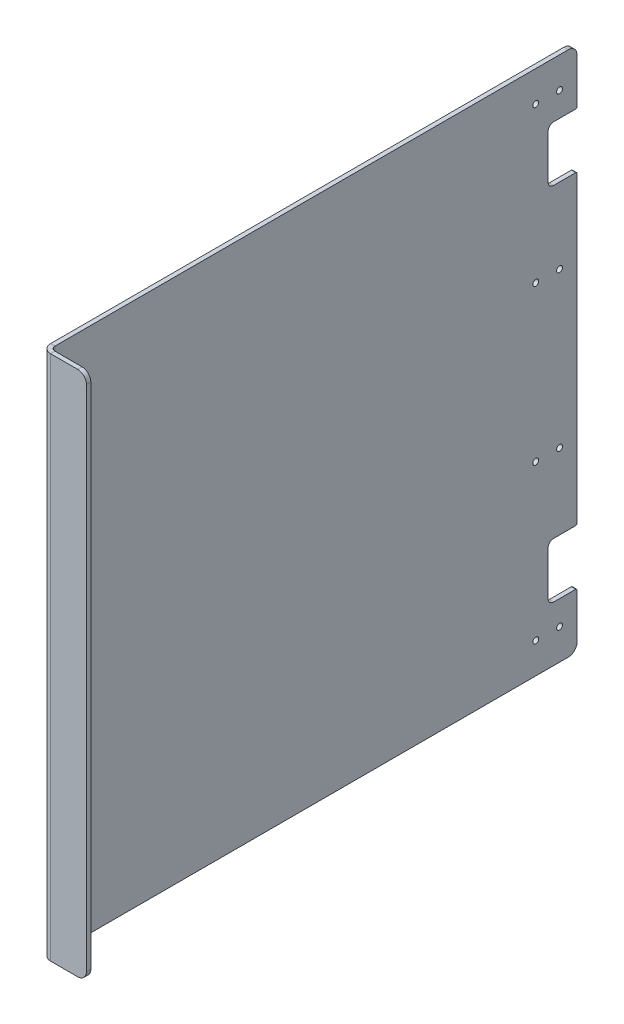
ISO-10303-21;
HEADER;
FILE_DESCRIPTION(('STEP AP214'),'2;1');
FILE_NAME('part.step','',(''),(''),'','','');
FILE_SCHEMA(('AUTOMOTIVE_DESIGN { 1 0 10303 214 1 1 1 1 }'));
ENDSEC;
DATA;
#1=APPLICATION_CONTEXT('core data for automotive mechanical design processes');
#2=APPLICATION_PROTOCOL_DEFINITION('international standard','automotive_design',2000,#1);
#3=PRODUCT_CONTEXT('',#1,'mechanical');
#4=PRODUCT('Part','Part','',(#3));
#5=PRODUCT_RELATED_PRODUCT_CATEGORY('part','',(#4));
#6=PRODUCT_DEFINITION_FORMATION('','',#4);
#7=PRODUCT_DEFINITION_CONTEXT('part definition',#1,'design');
#8=PRODUCT_DEFINITION('design','',#6,#7);
#9=PRODUCT_DEFINITION_SHAPE('','',#8);
#10=(LENGTH_UNIT() NAMED_UNIT(*) SI_UNIT(.MILLI.,.METRE.));
#11=(NAMED_UNIT(*) PLANE_ANGLE_UNIT() SI_UNIT($,.RADIAN.));
#12=(NAMED_UNIT(*) SI_UNIT($,.STERADIAN.) SOLID_ANGLE_UNIT());
#13=UNCERTAINTY_MEASURE_WITH_UNIT(LENGTH_MEASURE(1.E-05),#10,'distance_accuracy_value','');
#14=(GEOMETRIC_REPRESENTATION_CONTEXT(3) GLOBAL_UNCERTAINTY_ASSIGNED_CONTEXT((#13)) GLOBAL_UNIT_ASSIGNED_CONTEXT((#10,
#11,#12)) REPRESENTATION_CONTEXT('',''));
#15=CARTESIAN_POINT('',(0.,0.,0.));
#16=DIRECTION('',(0.,0.,1.));
#17=DIRECTION('',(1.,0.,0.));
#18=AXIS2_PLACEMENT_3D('',#15,#16,#17);
#19=CARTESIAN_POINT('',(-3.175,-191.,-385.5));
#20=DIRECTION('',(0.,0.,-1.));
#21=DIRECTION('',(-1.,0.,0.));
#22=AXIS2_PLACEMENT_3D('',#19,#20,#21);
#23=PLANE('',#22);
#24=DIRECTION('',(0.,1.,0.));
#25=VECTOR('',#24,1.);
#26=CARTESIAN_POINT('',(0.,-191.,-385.5));
#27=LINE('',#26,#25);
#28=CARTESIAN_POINT('',(0.,152.,-385.5));
#29=VERTEX_POINT('',#28);
#30=CARTESIAN_POINT('',(0.,184.65,-385.5));
#31=VERTEX_POINT('',#30);
#32=EDGE_CURVE('E329',#29,#31,#27,.T.);
#33=ORIENTED_EDGE('',*,*,#32,.F.);
#34=DIRECTION('',(-1.,0.,0.));
#35=VECTOR('',#34,1.);
#36=CARTESIAN_POINT('',(-3.175,152.,-385.5));
#37=LINE('',#36,#35);
#38=CARTESIAN_POINT('',(-3.175,152.,-385.5));
#39=VERTEX_POINT('',#38);
#40=EDGE_CURVE('E427',#29,#39,#37,.T.);
#41=ORIENTED_EDGE('',*,*,#40,.T.);
#42=DIRECTION('',(0.,1.,0.));
#43=VECTOR('',#42,1.);
#44=CARTESIAN_POINT('',(-3.175,-191.,-385.5));
#45=LINE('',#44,#43);
#46=CARTESIAN_POINT('',(-3.175,184.65,-385.5));
#47=VERTEX_POINT('',#46);
#48=EDGE_CURVE('E318',#39,#47,#45,.T.);
#49=ORIENTED_EDGE('',*,*,#48,.T.);
#50=DIRECTION('',(1.,0.,0.));
#51=VECTOR('',#50,1.);
#52=CARTESIAN_POINT('',(-3.175,184.65,-385.5));
#53=LINE('',#52,#51);
#54=EDGE_CURVE('E336',#47,#31,#53,.T.);
#55=ORIENTED_EDGE('',*,*,#54,.T.);
#56=EDGE_LOOP('',(#33,#41,#49,#55));
#57=FACE_BOUND('',#56,.T.);
#58=ADVANCED_FACE('F60',(#57),#23,.T.);
#59=CARTESIAN_POINT('',(-3.175,-110.,-385.5));
#60=VERTEX_POINT('',#59);
#61=CARTESIAN_POINT('',(-3.175,110.,-385.5));
#62=VERTEX_POINT('',#61);
#63=EDGE_CURVE('E324',#60,#62,#45,.T.);
#64=ORIENTED_EDGE('',*,*,#63,.T.);
#65=DIRECTION('',(-1.,0.,0.));
#66=VECTOR('',#65,1.);
#67=CARTESIAN_POINT('',(-3.175,110.,-385.5));
#68=LINE('',#67,#66);
#69=CARTESIAN_POINT('',(0.,110.,-385.5));
#70=VERTEX_POINT('',#69);
#71=EDGE_CURVE('E13',#62,#70,#68,.F.);
#72=ORIENTED_EDGE('',*,*,#71,.T.);
#73=CARTESIAN_POINT('',(0.,-110.,-385.5));
#74=VERTEX_POINT('',#73);
#75=EDGE_CURVE('E333',#74,#70,#27,.T.);
#76=ORIENTED_EDGE('',*,*,#75,.F.);
#77=DIRECTION('',(-1.,0.,0.));
#78=VECTOR('',#77,1.);
#79=CARTESIAN_POINT('',(-3.175,-110.,-385.5));
#80=LINE('',#79,#78);
#81=EDGE_CURVE('E403',#74,#60,#80,.T.);
#82=ORIENTED_EDGE('',*,*,#81,.T.);
#83=EDGE_LOOP('',(#64,#72,#76,#82));
#84=FACE_BOUND('',#83,.T.);
#85=ADVANCED_FACE('F492',(#84),#23,.T.);
#86=CARTESIAN_POINT('',(-3.175,0.,0.));
#87=DIRECTION('',(-1.,0.,0.));
#88=DIRECTION('',(0.,0.,1.));
#89=AXIS2_PLACEMENT_3D('',#86,#87,#88);
#90=PLANE('',#89);
#91=CARTESIAN_POINT('',(-3.175,168.65,-372.8));
#92=DIRECTION('',(-1.,0.,0.));
#93=DIRECTION('',(0.,0.,1.));
#94=AXIS2_PLACEMENT_3D('',#91,#92,#93);
#95=CIRCLE('',#94,2.14999999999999);
#96=CARTESIAN_POINT('',(-3.175,168.65,-370.65));
#97=VERTEX_POINT('',#96);
#98=EDGE_CURVE('E672',#97,#97,#95,.T.);
#99=ORIENTED_EDGE('',*,*,#98,.F.);
#100=EDGE_LOOP('',(#99));
#101=FACE_BOUND('',#100,.T.);
#102=CARTESIAN_POINT('',(-3.175,168.65,-355.5));
#103=DIRECTION('',(-1.,0.,0.));
#104=DIRECTION('',(0.,0.,1.));
#105=AXIS2_PLACEMENT_3D('',#102,#103,#104);
#106=CIRCLE('',#105,2.14999999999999);
#107=CARTESIAN_POINT('',(-3.175,168.65,-353.35));
#108=VERTEX_POINT('',#107);
#109=EDGE_CURVE('E666',#108,#108,#106,.T.);
#110=ORIENTED_EDGE('',*,*,#109,.F.);
#111=EDGE_LOOP('',(#110));
#112=FACE_BOUND('',#111,.T.);
#113=CARTESIAN_POINT('',(-3.175,56.2166666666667,-355.5));
#114=DIRECTION('',(-1.,0.,0.));
#115=DIRECTION('',(0.,0.,1.));
#116=AXIS2_PLACEMENT_3D('',#113,#114,#115);
#117=CIRCLE('',#116,2.14999999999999);
#118=CARTESIAN_POINT('',(-3.175,56.2166666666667,-353.35));
#119=VERTEX_POINT('',#118);
#120=EDGE_CURVE('E660',#119,#119,#117,.T.);
#121=ORIENTED_EDGE('',*,*,#120,.F.);
#122=EDGE_LOOP('',(#121));
#123=FACE_BOUND('',#122,.T.);
#124=CARTESIAN_POINT('',(-3.175,56.2166666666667,-372.8));
#125=DIRECTION('',(-1.,0.,0.));
#126=DIRECTION('',(0.,0.,1.));
#127=AXIS2_PLACEMENT_3D('',#124,#125,#126);
#128=CIRCLE('',#127,2.14999999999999);
#129=CARTESIAN_POINT('',(-3.175,56.2166666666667,-370.65));
#130=VERTEX_POINT('',#129);
#131=EDGE_CURVE('E654',#130,#130,#128,.T.);
#132=ORIENTED_EDGE('',*,*,#131,.F.);
#133=EDGE_LOOP('',(#132));
#134=FACE_BOUND('',#133,.T.);
#135=CARTESIAN_POINT('',(-3.175,-56.2166666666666,-355.5));
#136=DIRECTION('',(-1.,0.,0.));
#137=DIRECTION('',(0.,0.,1.));
#138=AXIS2_PLACEMENT_3D('',#135,#136,#137);
#139=CIRCLE('',#138,2.14999999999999);
#140=CARTESIAN_POINT('',(-3.175,-56.2166666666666,-353.35));
#141=VERTEX_POINT('',#140);
#142=EDGE_CURVE('E648',#141,#141,#139,.T.);
#143=ORIENTED_EDGE('',*,*,#142,.F.);
#144=EDGE_LOOP('',(#143));
#145=FACE_BOUND('',#144,.T.);
#146=CARTESIAN_POINT('',(-3.175,-56.2166666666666,-372.8));
#147=DIRECTION('',(-1.,0.,0.));
#148=DIRECTION('',(0.,0.,1.));
#149=AXIS2_PLACEMENT_3D('',#146,#147,#148);
#150=CIRCLE('',#149,2.14999999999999);
#151=CARTESIAN_POINT('',(-3.175,-56.2166666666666,-370.65));
#152=VERTEX_POINT('',#151);
#153=EDGE_CURVE('E642',#152,#152,#150,.T.);
#154=ORIENTED_EDGE('',*,*,#153,.F.);
#155=EDGE_LOOP('',(#154));
#156=FACE_BOUND('',#155,.T.);
#157=CARTESIAN_POINT('',(-3.175,-168.65,-372.8));
#158=DIRECTION('',(-1.,0.,0.));
#159=DIRECTION('',(0.,0.,1.));
#160=AXIS2_PLACEMENT_3D('',#157,#158,#159);
#161=CIRCLE('',#160,2.14999999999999);
#162=CARTESIAN_POINT('',(-3.175,-168.65,-370.65));
#163=VERTEX_POINT('',#162);
#164=EDGE_CURVE('E636',#163,#163,#161,.T.);
#165=ORIENTED_EDGE('',*,*,#164,.F.);
#166=EDGE_LOOP('',(#165));
#167=FACE_BOUND('',#166,.T.);
#168=CARTESIAN_POINT('',(-3.175,-168.65,-355.5));
#169=DIRECTION('',(-1.,0.,0.));
#170=DIRECTION('',(0.,0.,1.));
#171=AXIS2_PLACEMENT_3D('',#168,#169,#170);
#172=CIRCLE('',#171,2.14999999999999);
#173=CARTESIAN_POINT('',(-3.175,-168.65,-353.35));
#174=VERTEX_POINT('',#173);
#175=EDGE_CURVE('E459',#174,#174,#172,.T.);
#176=ORIENTED_EDGE('',*,*,#175,.F.);
#177=EDGE_LOOP('',(#176));
#178=FACE_BOUND('',#177,.T.);
#179=ORIENTED_EDGE('',*,*,#48,.F.);
#180=CARTESIAN_POINT('',(-3.175,152.,-384.5));
#181=DIRECTION('',(-1.,0.,0.));
#182=DIRECTION('',(0.,0.,1.));
#183=AXIS2_PLACEMENT_3D('',#180,#181,#182);
#184=CIRCLE('',#183,1.);
#185=CARTESIAN_POINT('',(-3.175,151.,-384.5));
#186=VERTEX_POINT('',#185);
#187=EDGE_CURVE('E432',#39,#186,#184,.T.);
#188=ORIENTED_EDGE('',*,*,#187,.T.);
#189=DIRECTION('',(0.,0.,1.));
#190=VECTOR('',#189,1.);
#191=CARTESIAN_POINT('',(-3.175,151.,-385.5));
#192=LINE('',#191,#190);
#193=CARTESIAN_POINT('',(-3.175,151.,-368.5));
#194=VERTEX_POINT('',#193);
#195=EDGE_CURVE('E456',#186,#194,#192,.T.);
#196=ORIENTED_EDGE('',*,*,#195,.T.);
#197=CARTESIAN_POINT('',(-3.175,147.,-368.5));
#198=DIRECTION('',(-1.,0.,0.));
#199=DIRECTION('',(0.,0.,1.));
#200=AXIS2_PLACEMENT_3D('',#197,#198,#199);
#201=CIRCLE('',#200,4.);
#202=CARTESIAN_POINT('',(-3.175,147.,-364.5));
#203=VERTEX_POINT('',#202);
#204=EDGE_CURVE('E418',#194,#203,#201,.F.);
#205=ORIENTED_EDGE('',*,*,#204,.T.);
#206=DIRECTION('',(0.,-1.,0.));
#207=VECTOR('',#206,1.);
#208=CARTESIAN_POINT('',(-3.175,151.,-364.5));
#209=LINE('',#208,#207);
#210=CARTESIAN_POINT('',(-3.175,115.,-364.5));
#211=VERTEX_POINT('',#210);
#212=EDGE_CURVE('E453',#203,#211,#209,.T.);
#213=ORIENTED_EDGE('',*,*,#212,.T.);
#214=CARTESIAN_POINT('',(-3.175,115.,-368.5));
#215=DIRECTION('',(-1.,0.,0.));
#216=DIRECTION('',(0.,0.,1.));
#217=AXIS2_PLACEMENT_3D('',#214,#215,#216);
#218=CIRCLE('',#217,4.);
#219=CARTESIAN_POINT('',(-3.175,111.,-368.5));
#220=VERTEX_POINT('',#219);
#221=EDGE_CURVE('E423',#211,#220,#218,.F.);
#222=ORIENTED_EDGE('',*,*,#221,.T.);
#223=DIRECTION('',(0.,0.,-1.));
#224=VECTOR('',#223,1.);
#225=CARTESIAN_POINT('',(-3.175,111.,-385.5));
#226=LINE('',#225,#224);
#227=CARTESIAN_POINT('',(-3.175,111.,-384.5));
#228=VERTEX_POINT('',#227);
#229=EDGE_CURVE('E444',#220,#228,#226,.T.);
#230=ORIENTED_EDGE('',*,*,#229,.T.);
#231=CARTESIAN_POINT('',(-3.175,110.,-384.5));
#232=DIRECTION('',(-1.,0.,0.));
#233=DIRECTION('',(0.,0.,1.));
#234=AXIS2_PLACEMENT_3D('',#231,#232,#233);
#235=CIRCLE('',#234,1.);
#236=EDGE_CURVE('E430',#228,#62,#235,.T.);
#237=ORIENTED_EDGE('',*,*,#236,.T.);
#238=ORIENTED_EDGE('',*,*,#63,.F.);
#239=CARTESIAN_POINT('',(-3.175,-110.,-384.5));
#240=DIRECTION('',(-1.,0.,0.));
#241=DIRECTION('',(0.,0.,1.));
#242=AXIS2_PLACEMENT_3D('',#239,#240,#241);
#243=CIRCLE('',#242,1.);
#244=CARTESIAN_POINT('',(-3.175,-111.,-384.5));
#245=VERTEX_POINT('',#244);
#246=EDGE_CURVE('E393',#60,#245,#243,.T.);
#247=ORIENTED_EDGE('',*,*,#246,.T.);
#248=DIRECTION('',(0.,0.,-1.));
#249=VECTOR('',#248,1.);
#250=CARTESIAN_POINT('',(-3.175,-111.,-385.5));
#251=LINE('',#250,#249);
#252=CARTESIAN_POINT('',(-3.175,-111.,-368.5));
#253=VERTEX_POINT('',#252);
#254=EDGE_CURVE('E469',#253,#245,#251,.T.);
#255=ORIENTED_EDGE('',*,*,#254,.F.);
#256=CARTESIAN_POINT('',(-3.175,-115.,-368.5));
#257=DIRECTION('',(-1.,0.,0.));
#258=DIRECTION('',(0.,0.,1.));
#259=AXIS2_PLACEMENT_3D('',#256,#257,#258);
#260=CIRCLE('',#259,4.);
#261=CARTESIAN_POINT('',(-3.175,-115.,-364.5));
#262=VERTEX_POINT('',#261);
#263=EDGE_CURVE('E386',#253,#262,#260,.F.);
#264=ORIENTED_EDGE('',*,*,#263,.T.);
#265=DIRECTION('',(0.,1.,0.));
#266=VECTOR('',#265,1.);
#267=CARTESIAN_POINT('',(-3.175,-151.,-364.5));
#268=LINE('',#267,#266);
#269=CARTESIAN_POINT('',(-3.175,-147.,-364.5));
#270=VERTEX_POINT('',#269);
#271=EDGE_CURVE('E476',#270,#262,#268,.T.);
#272=ORIENTED_EDGE('',*,*,#271,.F.);
#273=CARTESIAN_POINT('',(-3.175,-147.,-368.5));
#274=DIRECTION('',(-1.,0.,0.));
#275=DIRECTION('',(0.,0.,1.));
#276=AXIS2_PLACEMENT_3D('',#273,#274,#275);
#277=CIRCLE('',#276,4.);
#278=CARTESIAN_POINT('',(-3.175,-151.,-368.5));
#279=VERTEX_POINT('',#278);
#280=EDGE_CURVE('E381',#270,#279,#277,.F.);
#281=ORIENTED_EDGE('',*,*,#280,.T.);
#282=DIRECTION('',(0.,0.,1.));
#283=VECTOR('',#282,1.);
#284=CARTESIAN_POINT('',(-3.175,-151.,-385.5));
#285=LINE('',#284,#283);
#286=CARTESIAN_POINT('',(-3.175,-151.,-384.5));
#287=VERTEX_POINT('',#286);
#288=EDGE_CURVE('E474',#287,#279,#285,.T.);
#289=ORIENTED_EDGE('',*,*,#288,.F.);
#290=CARTESIAN_POINT('',(-3.175,-152.,-384.5));
#291=DIRECTION('',(-1.,0.,0.));
#292=DIRECTION('',(0.,0.,1.));
#293=AXIS2_PLACEMENT_3D('',#290,#291,#292);
#294=CIRCLE('',#293,1.);
#295=CARTESIAN_POINT('',(-3.175,-152.,-385.5));
#296=VERTEX_POINT('',#295);
#297=EDGE_CURVE('E395',#287,#296,#294,.T.);
#298=ORIENTED_EDGE('',*,*,#297,.T.);
#299=CARTESIAN_POINT('',(-3.175,-184.65,-385.5));
#300=VERTEX_POINT('',#299);
#301=EDGE_CURVE('E320',#300,#296,#45,.T.);
#302=ORIENTED_EDGE('',*,*,#301,.F.);
#303=CARTESIAN_POINT('',(-3.175,-184.65,-379.15));
#304=DIRECTION('',(-1.,0.,0.));
#305=DIRECTION('',(0.,0.,1.));
#306=AXIS2_PLACEMENT_3D('',#303,#304,#305);
#307=CIRCLE('',#306,6.35);
#308=CARTESIAN_POINT('',(-3.175,-191.,-379.15));
#309=VERTEX_POINT('',#308);
#310=EDGE_CURVE('E345',#300,#309,#307,.T.);
#311=ORIENTED_EDGE('',*,*,#310,.T.);
#312=DIRECTION('',(0.,0.,-1.));
#313=VECTOR('',#312,1.);
#314=CARTESIAN_POINT('',(-3.175,-191.,0.));
#315=LINE('',#314,#313);
#316=CARTESIAN_POINT('',(-3.17499999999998,-191.,-6.34999999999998));
#317=VERTEX_POINT('',#316);
#318=EDGE_CURVE('E315',#317,#309,#315,.T.);
#319=ORIENTED_EDGE('',*,*,#318,.F.);
#320=DIRECTION('',(0.,-1.,0.));
#321=VECTOR('',#320,1.);
#322=CARTESIAN_POINT('',(-3.17499999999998,-191.,-6.34999999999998));
#323=LINE('',#322,#321);
#324=CARTESIAN_POINT('',(-3.175,191.,-6.34999999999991));
#325=VERTEX_POINT('',#324);
#326=EDGE_CURVE('E254',#317,#325,#323,.F.);
#327=ORIENTED_EDGE('',*,*,#326,.T.);
#328=DIRECTION('',(0.,0.,1.));
#329=VECTOR('',#328,1.);
#330=CARTESIAN_POINT('',(-3.175,191.,0.));
#331=LINE('',#330,#329);
#332=CARTESIAN_POINT('',(-3.175,191.,-379.15));
#333=VERTEX_POINT('',#332);
#334=EDGE_CURVE('E323',#333,#325,#331,.T.);
#335=ORIENTED_EDGE('',*,*,#334,.F.);
#336=CARTESIAN_POINT('',(-3.175,184.65,-379.15));
#337=DIRECTION('',(-1.,0.,0.));
#338=DIRECTION('',(0.,0.,1.));
#339=AXIS2_PLACEMENT_3D('',#336,#337,#338);
#340=CIRCLE('',#339,6.35);
#341=EDGE_CURVE('E347',#333,#47,#340,.T.);
#342=ORIENTED_EDGE('',*,*,#341,.T.);
#343=EDGE_LOOP('',(#179,#188,#196,#205,#213,#222,#230,#237,#238,#247,#255,#264,#272,#281,#289,
#298,#302,#311,#319,#327,#335,#342));
#344=FACE_BOUND('',#343,.T.);
#345=ADVANCED_FACE('F450',(#101,#112,#123,#134,#145,#156,#167,#178,#344),#90,.T.);
#346=CARTESIAN_POINT('',(0.,0.,0.));
#347=DIRECTION('',(-1.,0.,0.));
#348=DIRECTION('',(0.,0.,1.));
#349=AXIS2_PLACEMENT_3D('',#346,#347,#348);
#350=PLANE('',#349);
#351=CARTESIAN_POINT('',(0.,168.65,-372.8));
#352=DIRECTION('',(-1.,0.,0.));
#353=DIRECTION('',(0.,0.,1.));
#354=AXIS2_PLACEMENT_3D('',#351,#352,#353);
#355=CIRCLE('',#354,2.15);
#356=CARTESIAN_POINT('',(0.,168.65,-370.65));
#357=VERTEX_POINT('',#356);
#358=EDGE_CURVE('E669',#357,#357,#355,.T.);
#359=ORIENTED_EDGE('',*,*,#358,.T.);
#360=EDGE_LOOP('',(#359));
#361=FACE_BOUND('',#360,.T.);
#362=CARTESIAN_POINT('',(0.,168.65,-355.5));
#363=DIRECTION('',(-1.,0.,0.));
#364=DIRECTION('',(0.,0.,1.));
#365=AXIS2_PLACEMENT_3D('',#362,#363,#364);
#366=CIRCLE('',#365,2.15);
#367=CARTESIAN_POINT('',(0.,168.65,-353.35));
#368=VERTEX_POINT('',#367);
#369=EDGE_CURVE('E663',#368,#368,#366,.T.);
#370=ORIENTED_EDGE('',*,*,#369,.T.);
#371=EDGE_LOOP('',(#370));
#372=FACE_BOUND('',#371,.T.);
#373=CARTESIAN_POINT('',(0.,56.2166666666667,-355.5));
#374=DIRECTION('',(-1.,0.,0.));
#375=DIRECTION('',(0.,0.,1.));
#376=AXIS2_PLACEMENT_3D('',#373,#374,#375);
#377=CIRCLE('',#376,2.14999999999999);
#378=CARTESIAN_POINT('',(0.,56.2166666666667,-353.35));
#379=VERTEX_POINT('',#378);
#380=EDGE_CURVE('E657',#379,#379,#377,.T.);
#381=ORIENTED_EDGE('',*,*,#380,.T.);
#382=EDGE_LOOP('',(#381));
#383=FACE_BOUND('',#382,.T.);
#384=CARTESIAN_POINT('',(0.,56.2166666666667,-372.8));
#385=DIRECTION('',(-1.,0.,0.));
#386=DIRECTION('',(0.,0.,1.));
#387=AXIS2_PLACEMENT_3D('',#384,#385,#386);
#388=CIRCLE('',#387,2.14999999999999);
#389=CARTESIAN_POINT('',(0.,56.2166666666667,-370.65));
#390=VERTEX_POINT('',#389);
#391=EDGE_CURVE('E651',#390,#390,#388,.T.);
#392=ORIENTED_EDGE('',*,*,#391,.T.);
#393=EDGE_LOOP('',(#392));
#394=FACE_BOUND('',#393,.T.);
#395=CARTESIAN_POINT('',(0.,-56.2166666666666,-355.5));
#396=DIRECTION('',(-1.,0.,0.));
#397=DIRECTION('',(0.,0.,1.));
#398=AXIS2_PLACEMENT_3D('',#395,#396,#397);
#399=CIRCLE('',#398,2.14999999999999);
#400=CARTESIAN_POINT('',(0.,-56.2166666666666,-353.35));
#401=VERTEX_POINT('',#400);
#402=EDGE_CURVE('E645',#401,#401,#399,.T.);
#403=ORIENTED_EDGE('',*,*,#402,.T.);
#404=EDGE_LOOP('',(#403));
#405=FACE_BOUND('',#404,.T.);
#406=CARTESIAN_POINT('',(0.,-56.2166666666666,-372.8));
#407=DIRECTION('',(-1.,0.,0.));
#408=DIRECTION('',(0.,0.,1.));
#409=AXIS2_PLACEMENT_3D('',#406,#407,#408);
#410=CIRCLE('',#409,2.14999999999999);
#411=CARTESIAN_POINT('',(0.,-56.2166666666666,-370.65));
#412=VERTEX_POINT('',#411);
#413=EDGE_CURVE('E639',#412,#412,#410,.T.);
#414=ORIENTED_EDGE('',*,*,#413,.T.);
#415=EDGE_LOOP('',(#414));
#416=FACE_BOUND('',#415,.T.);
#417=CARTESIAN_POINT('',(0.,-168.65,-372.8));
#418=DIRECTION('',(-1.,0.,0.));
#419=DIRECTION('',(0.,0.,1.));
#420=AXIS2_PLACEMENT_3D('',#417,#418,#419);
#421=CIRCLE('',#420,2.15);
#422=CARTESIAN_POINT('',(0.,-168.65,-370.65));
#423=VERTEX_POINT('',#422);
#424=EDGE_CURVE('E633',#423,#423,#421,.T.);
#425=ORIENTED_EDGE('',*,*,#424,.T.);
#426=EDGE_LOOP('',(#425));
#427=FACE_BOUND('',#426,.T.);
#428=CARTESIAN_POINT('',(0.,-168.65,-355.5));
#429=DIRECTION('',(-1.,0.,0.));
#430=DIRECTION('',(0.,0.,1.));
#431=AXIS2_PLACEMENT_3D('',#428,#429,#430);
#432=CIRCLE('',#431,2.15);
#433=CARTESIAN_POINT('',(0.,-168.65,-353.35));
#434=VERTEX_POINT('',#433);
#435=EDGE_CURVE('E454',#434,#434,#432,.T.);
#436=ORIENTED_EDGE('',*,*,#435,.T.);
#437=EDGE_LOOP('',(#436));
#438=FACE_BOUND('',#437,.T.);
#439=DIRECTION('',(0.,0.,1.));
#440=VECTOR('',#439,1.);
#441=CARTESIAN_POINT('',(0.,151.,-385.5));
#442=LINE('',#441,#440);
#443=CARTESIAN_POINT('',(0.,151.,-384.5));
#444=VERTEX_POINT('',#443);
#445=CARTESIAN_POINT('',(0.,151.,-368.5));
#446=VERTEX_POINT('',#445);
#447=EDGE_CURVE('E462',#444,#446,#442,.T.);
#448=ORIENTED_EDGE('',*,*,#447,.F.);
#449=CARTESIAN_POINT('',(0.,152.,-384.5));
#450=DIRECTION('',(-1.,0.,0.));
#451=DIRECTION('',(0.,0.,1.));
#452=AXIS2_PLACEMENT_3D('',#449,#450,#451);
#453=CIRCLE('',#452,1.);
#454=EDGE_CURVE('E437',#444,#29,#453,.F.);
#455=ORIENTED_EDGE('',*,*,#454,.T.);
#456=ORIENTED_EDGE('',*,*,#32,.T.);
#457=CARTESIAN_POINT('',(0.,184.65,-379.15));
#458=DIRECTION('',(-1.,0.,0.));
#459=DIRECTION('',(0.,0.,1.));
#460=AXIS2_PLACEMENT_3D('',#457,#458,#459);
#461=CIRCLE('',#460,6.35);
#462=CARTESIAN_POINT('',(0.,191.,-379.15));
#463=VERTEX_POINT('',#462);
#464=EDGE_CURVE('E341',#31,#463,#461,.F.);
#465=ORIENTED_EDGE('',*,*,#464,.T.);
#466=DIRECTION('',(0.,0.,1.));
#467=VECTOR('',#466,1.);
#468=CARTESIAN_POINT('',(0.,191.,0.));
#469=LINE('',#468,#467);
#470=CARTESIAN_POINT('',(0.,191.,-6.34999999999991));
#471=VERTEX_POINT('',#470);
#472=EDGE_CURVE('E319',#463,#471,#469,.T.);
#473=ORIENTED_EDGE('',*,*,#472,.T.);
#474=DIRECTION('',(0.,-1.,0.));
#475=VECTOR('',#474,1.);
#476=CARTESIAN_POINT('',(0.,-191.,-6.35000000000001));
#477=LINE('',#476,#475);
#478=CARTESIAN_POINT('',(0.,-191.,-6.35000000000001));
#479=VERTEX_POINT('',#478);
#480=EDGE_CURVE('E306',#479,#471,#477,.F.);
#481=ORIENTED_EDGE('',*,*,#480,.F.);
#482=DIRECTION('',(0.,0.,-1.));
#483=VECTOR('',#482,1.);
#484=CARTESIAN_POINT('',(0.,-191.,0.));
#485=LINE('',#484,#483);
#486=CARTESIAN_POINT('',(0.,-191.,-379.15));
#487=VERTEX_POINT('',#486);
#488=EDGE_CURVE('E313',#479,#487,#485,.T.);
#489=ORIENTED_EDGE('',*,*,#488,.T.);
#490=CARTESIAN_POINT('',(0.,-184.65,-379.15));
#491=DIRECTION('',(-1.,0.,0.));
#492=DIRECTION('',(0.,0.,1.));
#493=AXIS2_PLACEMENT_3D('',#490,#491,#492);
#494=CIRCLE('',#493,6.35);
#495=CARTESIAN_POINT('',(0.,-184.65,-385.5));
#496=VERTEX_POINT('',#495);
#497=EDGE_CURVE('E339',#487,#496,#494,.F.);
#498=ORIENTED_EDGE('',*,*,#497,.T.);
#499=CARTESIAN_POINT('',(0.,-152.,-385.5));
#500=VERTEX_POINT('',#499);
#501=EDGE_CURVE('E330',#496,#500,#27,.T.);
#502=ORIENTED_EDGE('',*,*,#501,.T.);
#503=CARTESIAN_POINT('',(0.,-152.,-384.5));
#504=DIRECTION('',(-1.,0.,0.));
#505=DIRECTION('',(0.,0.,1.));
#506=AXIS2_PLACEMENT_3D('',#503,#504,#505);
#507=CIRCLE('',#506,1.);
#508=CARTESIAN_POINT('',(0.,-151.,-384.5));
#509=VERTEX_POINT('',#508);
#510=EDGE_CURVE('E401',#500,#509,#507,.F.);
#511=ORIENTED_EDGE('',*,*,#510,.T.);
#512=DIRECTION('',(0.,0.,1.));
#513=VECTOR('',#512,1.);
#514=CARTESIAN_POINT('',(0.,-151.,-385.5));
#515=LINE('',#514,#513);
#516=CARTESIAN_POINT('',(0.,-151.,-368.5));
#517=VERTEX_POINT('',#516);
#518=EDGE_CURVE('E466',#509,#517,#515,.T.);
#519=ORIENTED_EDGE('',*,*,#518,.T.);
#520=CARTESIAN_POINT('',(0.,-147.,-368.5));
#521=DIRECTION('',(-1.,0.,0.));
#522=DIRECTION('',(0.,0.,1.));
#523=AXIS2_PLACEMENT_3D('',#520,#521,#522);
#524=CIRCLE('',#523,4.);
#525=CARTESIAN_POINT('',(0.,-147.,-364.5));
#526=VERTEX_POINT('',#525);
#527=EDGE_CURVE('E384',#517,#526,#524,.T.);
#528=ORIENTED_EDGE('',*,*,#527,.T.);
#529=DIRECTION('',(0.,1.,0.));
#530=VECTOR('',#529,1.);
#531=CARTESIAN_POINT('',(0.,-151.,-364.5));
#532=LINE('',#531,#530);
#533=CARTESIAN_POINT('',(0.,-115.,-364.5));
#534=VERTEX_POINT('',#533);
#535=EDGE_CURVE('E468',#526,#534,#532,.T.);
#536=ORIENTED_EDGE('',*,*,#535,.T.);
#537=CARTESIAN_POINT('',(0.,-115.,-368.5));
#538=DIRECTION('',(-1.,0.,0.));
#539=DIRECTION('',(0.,0.,1.));
#540=AXIS2_PLACEMENT_3D('',#537,#538,#539);
#541=CIRCLE('',#540,4.);
#542=CARTESIAN_POINT('',(0.,-111.,-368.5));
#543=VERTEX_POINT('',#542);
#544=EDGE_CURVE('E388',#534,#543,#541,.T.);
#545=ORIENTED_EDGE('',*,*,#544,.T.);
#546=DIRECTION('',(0.,0.,-1.));
#547=VECTOR('',#546,1.);
#548=CARTESIAN_POINT('',(0.,-111.,-385.5));
#549=LINE('',#548,#547);
#550=CARTESIAN_POINT('',(0.,-111.,-384.5));
#551=VERTEX_POINT('',#550);
#552=EDGE_CURVE('E299',#543,#551,#549,.T.);
#553=ORIENTED_EDGE('',*,*,#552,.T.);
#554=CARTESIAN_POINT('',(0.,-110.,-384.5));
#555=DIRECTION('',(-1.,0.,0.));
#556=DIRECTION('',(0.,0.,1.));
#557=AXIS2_PLACEMENT_3D('',#554,#555,#556);
#558=CIRCLE('',#557,1.);
#559=EDGE_CURVE('E399',#551,#74,#558,.F.);
#560=ORIENTED_EDGE('',*,*,#559,.T.);
#561=ORIENTED_EDGE('',*,*,#75,.T.);
#562=CARTESIAN_POINT('',(0.,110.,-384.5));
#563=DIRECTION('',(-1.,0.,0.));
#564=DIRECTION('',(0.,0.,1.));
#565=AXIS2_PLACEMENT_3D('',#562,#563,#564);
#566=CIRCLE('',#565,1.);
#567=CARTESIAN_POINT('',(0.,111.,-384.5));
#568=VERTEX_POINT('',#567);
#569=EDGE_CURVE('E75',#70,#568,#566,.F.);
#570=ORIENTED_EDGE('',*,*,#569,.T.);
#571=DIRECTION('',(0.,0.,-1.));
#572=VECTOR('',#571,1.);
#573=CARTESIAN_POINT('',(0.,111.,-385.5));
#574=LINE('',#573,#572);
#575=CARTESIAN_POINT('',(0.,111.,-368.5));
#576=VERTEX_POINT('',#575);
#577=EDGE_CURVE('E446',#576,#568,#574,.T.);
#578=ORIENTED_EDGE('',*,*,#577,.F.);
#579=CARTESIAN_POINT('',(0.,115.,-368.5));
#580=DIRECTION('',(-1.,0.,0.));
#581=DIRECTION('',(0.,0.,1.));
#582=AXIS2_PLACEMENT_3D('',#579,#580,#581);
#583=CIRCLE('',#582,4.);
#584=CARTESIAN_POINT('',(0.,115.,-364.5));
#585=VERTEX_POINT('',#584);
#586=EDGE_CURVE('E425',#576,#585,#583,.T.);
#587=ORIENTED_EDGE('',*,*,#586,.T.);
#588=DIRECTION('',(0.,-1.,0.));
#589=VECTOR('',#588,1.);
#590=CARTESIAN_POINT('',(0.,151.,-364.5));
#591=LINE('',#590,#589);
#592=CARTESIAN_POINT('',(0.,147.,-364.5));
#593=VERTEX_POINT('',#592);
#594=EDGE_CURVE('E627',#593,#585,#591,.T.);
#595=ORIENTED_EDGE('',*,*,#594,.F.);
#596=CARTESIAN_POINT('',(0.,147.,-368.5));
#597=DIRECTION('',(-1.,0.,0.));
#598=DIRECTION('',(0.,0.,1.));
#599=AXIS2_PLACEMENT_3D('',#596,#597,#598);
#600=CIRCLE('',#599,4.);
#601=EDGE_CURVE('E420',#593,#446,#600,.T.);
#602=ORIENTED_EDGE('',*,*,#601,.T.);
#603=EDGE_LOOP('',(#448,#455,#456,#465,#473,#481,#489,#498,#502,#511,#519,#528,#536,#545,#553,
#560,#561,#570,#578,#587,#595,#602));
#604=FACE_BOUND('',#603,.T.);
#605=ADVANCED_FACE('F491',(#361,#372,#383,#394,#405,#416,#427,#438,#604),#350,.F.);
#606=CARTESIAN_POINT('',(-3.175,-191.,0.));
#607=DIRECTION('',(0.,-1.,0.));
#608=DIRECTION('',(0.,0.,-1.));
#609=AXIS2_PLACEMENT_3D('',#606,#607,#608);
#610=PLANE('',#609);
#611=ORIENTED_EDGE('',*,*,#318,.T.);
#612=DIRECTION('',(1.,0.,0.));
#613=VECTOR('',#612,1.);
#614=CARTESIAN_POINT('',(-3.175,-191.,-379.15));
#615=LINE('',#614,#613);
#616=EDGE_CURVE('E350',#309,#487,#615,.T.);
#617=ORIENTED_EDGE('',*,*,#616,.T.);
#618=ORIENTED_EDGE('',*,*,#488,.F.);
#619=DIRECTION('',(-1.,0.,0.));
#620=VECTOR('',#619,1.);
#621=CARTESIAN_POINT('',(0.,-191.,-6.35000000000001));
#622=LINE('',#621,#620);
#623=EDGE_CURVE('E302',#479,#317,#622,.T.);
#624=ORIENTED_EDGE('',*,*,#623,.T.);
#625=EDGE_LOOP('',(#611,#617,#618,#624));
#626=FACE_BOUND('',#625,.T.);
#627=ADVANCED_FACE('F562',(#626),#610,.T.);
#628=CARTESIAN_POINT('',(-3.175,191.,0.));
#629=DIRECTION('',(0.,1.,0.));
#630=DIRECTION('',(0.,0.,1.));
#631=AXIS2_PLACEMENT_3D('',#628,#629,#630);
#632=PLANE('',#631);
#633=ORIENTED_EDGE('',*,*,#472,.F.);
#634=DIRECTION('',(1.,0.,0.));
#635=VECTOR('',#634,1.);
#636=CARTESIAN_POINT('',(-3.175,191.,-379.15));
#637=LINE('',#636,#635);
#638=EDGE_CURVE('E343',#463,#333,#637,.F.);
#639=ORIENTED_EDGE('',*,*,#638,.T.);
#640=ORIENTED_EDGE('',*,*,#334,.T.);
#641=DIRECTION('',(-1.,0.,0.));
#642=VECTOR('',#641,1.);
#643=CARTESIAN_POINT('',(0.,191.,-6.34999999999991));
#644=LINE('',#643,#642);
#645=EDGE_CURVE('E310',#471,#325,#644,.T.);
#646=ORIENTED_EDGE('',*,*,#645,.F.);
#647=EDGE_LOOP('',(#633,#639,#640,#646));
#648=FACE_BOUND('',#647,.T.);
#649=ADVANCED_FACE('F508',(#648),#632,.T.);
#650=ORIENTED_EDGE('',*,*,#301,.T.);
#651=DIRECTION('',(-1.,0.,0.));
#652=VECTOR('',#651,1.);
#653=CARTESIAN_POINT('',(0.,-152.,-385.5));
#654=LINE('',#653,#652);
#655=EDGE_CURVE('E397',#296,#500,#654,.F.);
#656=ORIENTED_EDGE('',*,*,#655,.T.);
#657=ORIENTED_EDGE('',*,*,#501,.F.);
#658=DIRECTION('',(1.,0.,0.));
#659=VECTOR('',#658,1.);
#660=CARTESIAN_POINT('',(-3.175,-184.65,-385.5));
#661=LINE('',#660,#659);
#662=EDGE_CURVE('E326',#496,#300,#661,.F.);
#663=ORIENTED_EDGE('',*,*,#662,.T.);
#664=EDGE_LOOP('',(#650,#656,#657,#663));
#665=FACE_BOUND('',#664,.T.);
#666=ADVANCED_FACE('F546',(#665),#23,.T.);
#667=CARTESIAN_POINT('',(3.17499999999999,191.,-6.34999999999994));
#668=DIRECTION('',(0.,1.,0.));
#669=DIRECTION('',(0.,0.,1.));
#670=AXIS2_PLACEMENT_3D('',#667,#668,#669);
#671=PLANE('',#670);
#672=DIRECTION('',(0.,0.,-1.));
#673=VECTOR('',#672,1.);
#674=CARTESIAN_POINT('',(3.17499999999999,191.,0.));
#675=LINE('',#674,#673);
#676=CARTESIAN_POINT('',(3.17499999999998,191.,-3.17499999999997));
#677=VERTEX_POINT('',#676);
#678=CARTESIAN_POINT('',(3.17499999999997,191.,0.));
#679=VERTEX_POINT('',#678);
#680=EDGE_CURVE('E296',#677,#679,#675,.F.);
#681=ORIENTED_EDGE('',*,*,#680,.F.);
#682=CARTESIAN_POINT('',(3.17499999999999,191.,-6.34999999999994));
#683=DIRECTION('',(0.,-1.,0.));
#684=DIRECTION('',(0.,0.,-1.));
#685=AXIS2_PLACEMENT_3D('',#682,#683,#684);
#686=CIRCLE('',#685,3.17499999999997);
#687=EDGE_CURVE('E257',#471,#677,#686,.F.);
#688=ORIENTED_EDGE('',*,*,#687,.F.);
#689=ORIENTED_EDGE('',*,*,#645,.T.);
#690=CARTESIAN_POINT('',(3.17499999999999,191.,-6.34999999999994));
#691=DIRECTION('',(0.,-1.,0.));
#692=DIRECTION('',(0.,0.,-1.));
#693=AXIS2_PLACEMENT_3D('',#690,#691,#692);
#694=CIRCLE('',#693,6.34999999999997);
#695=EDGE_CURVE('E301',#325,#679,#694,.F.);
#696=ORIENTED_EDGE('',*,*,#695,.T.);
#697=EDGE_LOOP('',(#681,#688,#689,#696));
#698=FACE_BOUND('',#697,.T.);
#699=ADVANCED_FACE('F512',(#698),#671,.T.);
#700=CARTESIAN_POINT('',(3.17499999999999,-191.,-6.35000000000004));
#701=DIRECTION('',(0.,1.,0.));
#702=DIRECTION('',(0.,0.,1.));
#703=AXIS2_PLACEMENT_3D('',#700,#701,#702);
#704=PLANE('',#703);
#705=CARTESIAN_POINT('',(3.17499999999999,-191.,-6.35000000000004));
#706=DIRECTION('',(0.,-1.,0.));
#707=DIRECTION('',(0.,0.,-1.));
#708=AXIS2_PLACEMENT_3D('',#705,#706,#707);
#709=CIRCLE('',#708,3.17499999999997);
#710=CARTESIAN_POINT('',(3.17499999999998,-191.,-3.17500000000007));
#711=VERTEX_POINT('',#710);
#712=EDGE_CURVE('E264',#711,#479,#709,.T.);
#713=ORIENTED_EDGE('',*,*,#712,.F.);
#714=DIRECTION('',(0.,0.,-1.));
#715=VECTOR('',#714,1.);
#716=CARTESIAN_POINT('',(3.175,-191.,-3.17500000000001));
#717=LINE('',#716,#715);
#718=CARTESIAN_POINT('',(3.175,-191.,0.));
#719=VERTEX_POINT('',#718);
#720=EDGE_CURVE('E261',#711,#719,#717,.F.);
#721=ORIENTED_EDGE('',*,*,#720,.T.);
#722=CARTESIAN_POINT('',(3.17499999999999,-191.,-6.35000000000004));
#723=DIRECTION('',(0.,-1.,0.));
#724=DIRECTION('',(0.,0.,-1.));
#725=AXIS2_PLACEMENT_3D('',#722,#723,#724);
#726=CIRCLE('',#725,6.34999999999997);
#727=EDGE_CURVE('E246',#719,#317,#726,.T.);
#728=ORIENTED_EDGE('',*,*,#727,.T.);
#729=ORIENTED_EDGE('',*,*,#623,.F.);
#730=EDGE_LOOP('',(#713,#721,#728,#729));
#731=FACE_BOUND('',#730,.T.);
#732=ADVANCED_FACE('F262',(#731),#704,.F.);
#733=CARTESIAN_POINT('',(3.17499999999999,-191.,-6.35000000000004));
#734=DIRECTION('',(0.,-1.,0.));
#735=DIRECTION('',(0.,0.,1.));
#736=AXIS2_PLACEMENT_3D('',#733,#734,#735);
#737=CYLINDRICAL_SURFACE('',#736,6.34999999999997);
#738=ORIENTED_EDGE('',*,*,#326,.F.);
#739=ORIENTED_EDGE('',*,*,#727,.F.);
#740=DIRECTION('',(0.,-1.,0.));
#741=VECTOR('',#740,1.);
#742=CARTESIAN_POINT('',(3.17499999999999,191.,0.));
#743=LINE('',#742,#741);
#744=EDGE_CURVE('E251',#719,#679,#743,.F.);
#745=ORIENTED_EDGE('',*,*,#744,.T.);
#746=ORIENTED_EDGE('',*,*,#695,.F.);
#747=EDGE_LOOP('',(#738,#739,#745,#746));
#748=FACE_BOUND('',#747,.T.);
#749=ADVANCED_FACE('F248',(#748),#737,.T.);
#750=CARTESIAN_POINT('',(3.17499999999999,-191.,-6.35000000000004));
#751=DIRECTION('',(0.,-1.,0.));
#752=DIRECTION('',(0.,0.,1.));
#753=AXIS2_PLACEMENT_3D('',#750,#751,#752);
#754=CYLINDRICAL_SURFACE('',#753,3.17499999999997);
#755=ORIENTED_EDGE('',*,*,#480,.T.);
#756=ORIENTED_EDGE('',*,*,#687,.T.);
#757=DIRECTION('',(0.,-1.,0.));
#758=VECTOR('',#757,1.);
#759=CARTESIAN_POINT('',(3.17499999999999,191.,-3.17499999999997));
#760=LINE('',#759,#758);
#761=EDGE_CURVE('E269',#677,#711,#760,.T.);
#762=ORIENTED_EDGE('',*,*,#761,.T.);
#763=ORIENTED_EDGE('',*,*,#712,.T.);
#764=EDGE_LOOP('',(#755,#756,#762,#763));
#765=FACE_BOUND('',#764,.T.);
#766=ADVANCED_FACE('F515',(#765),#754,.F.);
#767=CARTESIAN_POINT('',(29.237500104,-191.,0.));
#768=DIRECTION('',(0.,1.,0.));
#769=DIRECTION('',(-1.,0.,0.));
#770=AXIS2_PLACEMENT_3D('',#767,#768,#769);
#771=PLANE('',#770);
#772=DIRECTION('',(-1.,0.,0.));
#773=VECTOR('',#772,1.);
#774=CARTESIAN_POINT('',(29.237500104,-191.,-3.17499999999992));
#775=LINE('',#774,#773);
#776=CARTESIAN_POINT('',(22.887500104,-191.,-3.17499999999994));
#777=VERTEX_POINT('',#776);
#778=EDGE_CURVE('E279',#711,#777,#775,.F.);
#779=ORIENTED_EDGE('',*,*,#778,.T.);
#780=DIRECTION('',(0.,0.,-1.));
#781=VECTOR('',#780,1.);
#782=CARTESIAN_POINT('',(22.887500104,-191.,0.));
#783=LINE('',#782,#781);
#784=CARTESIAN_POINT('',(22.887500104,-191.,0.));
#785=VERTEX_POINT('',#784);
#786=EDGE_CURVE('E283',#777,#785,#783,.F.);
#787=ORIENTED_EDGE('',*,*,#786,.T.);
#788=DIRECTION('',(1.,0.,0.));
#789=VECTOR('',#788,1.);
#790=CARTESIAN_POINT('',(-3.73723498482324E-13,-191.,0.));
#791=LINE('',#790,#789);
#792=EDGE_CURVE('E275',#719,#785,#791,.T.);
#793=ORIENTED_EDGE('',*,*,#792,.F.);
#794=ORIENTED_EDGE('',*,*,#720,.F.);
#795=EDGE_LOOP('',(#779,#787,#793,#794));
#796=FACE_BOUND('',#795,.T.);
#797=ADVANCED_FACE('F281',(#796),#771,.F.);
#798=CARTESIAN_POINT('',(0.,191.,0.));
#799=DIRECTION('',(0.,-1.,0.));
#800=DIRECTION('',(0.,0.,-1.));
#801=AXIS2_PLACEMENT_3D('',#798,#799,#800);
#802=PLANE('',#801);
#803=DIRECTION('',(-1.,0.,0.));
#804=VECTOR('',#803,1.);
#805=CARTESIAN_POINT('',(0.,191.,0.));
#806=LINE('',#805,#804);
#807=CARTESIAN_POINT('',(22.887500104,191.,1.02462684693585E-13));
#808=VERTEX_POINT('',#807);
#809=EDGE_CURVE('E278',#808,#679,#806,.T.);
#810=ORIENTED_EDGE('',*,*,#809,.F.);
#811=DIRECTION('',(0.,0.,-1.));
#812=VECTOR('',#811,1.);
#813=CARTESIAN_POINT('',(22.887500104,191.,1.02462684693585E-13));
#814=LINE('',#813,#812);
#815=CARTESIAN_POINT('',(22.887500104,191.,-3.1749999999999));
#816=VERTEX_POINT('',#815);
#817=EDGE_CURVE('E353',#808,#816,#814,.T.);
#818=ORIENTED_EDGE('',*,*,#817,.T.);
#819=DIRECTION('',(1.,0.,0.));
#820=VECTOR('',#819,1.);
#821=CARTESIAN_POINT('',(0.,191.,-3.17499999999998));
#822=LINE('',#821,#820);
#823=EDGE_CURVE('E285',#816,#677,#822,.F.);
#824=ORIENTED_EDGE('',*,*,#823,.T.);
#825=ORIENTED_EDGE('',*,*,#680,.T.);
#826=EDGE_LOOP('',(#810,#818,#824,#825));
#827=FACE_BOUND('',#826,.T.);
#828=ADVANCED_FACE('F533',(#827),#802,.F.);
#829=CARTESIAN_POINT('',(0.,0.,0.));
#830=DIRECTION('',(0.,0.,-1.));
#831=DIRECTION('',(-1.,0.,0.));
#832=AXIS2_PLACEMENT_3D('',#829,#830,#831);
#833=PLANE('',#832);
#834=DIRECTION('',(0.,1.,0.));
#835=VECTOR('',#834,1.);
#836=CARTESIAN_POINT('',(29.237500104,0.,1.0208218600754E-13));
#837=LINE('',#836,#835);
#838=CARTESIAN_POINT('',(29.237500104,-184.65,0.));
#839=VERTEX_POINT('',#838);
#840=CARTESIAN_POINT('',(29.237500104,184.65,1.23883845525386E-13));
#841=VERTEX_POINT('',#840);
#842=EDGE_CURVE('E284',#839,#841,#837,.T.);
#843=ORIENTED_EDGE('',*,*,#842,.T.);
#844=CARTESIAN_POINT('',(22.887500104,184.65,1.01712939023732E-13));
#845=DIRECTION('',(0.,0.,-1.));
#846=DIRECTION('',(-1.,0.,0.));
#847=AXIS2_PLACEMENT_3D('',#844,#845,#846);
#848=CIRCLE('',#847,6.35);
#849=EDGE_CURVE('E367',#841,#808,#848,.F.);
#850=ORIENTED_EDGE('',*,*,#849,.T.);
#851=ORIENTED_EDGE('',*,*,#809,.T.);
#852=ORIENTED_EDGE('',*,*,#744,.F.);
#853=ORIENTED_EDGE('',*,*,#792,.T.);
#854=CARTESIAN_POINT('',(22.887500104,-184.65,0.));
#855=DIRECTION('',(0.,0.,-1.));
#856=DIRECTION('',(-1.,0.,0.));
#857=AXIS2_PLACEMENT_3D('',#854,#855,#856);
#858=CIRCLE('',#857,6.35);
#859=EDGE_CURVE('E365',#785,#839,#858,.F.);
#860=ORIENTED_EDGE('',*,*,#859,.T.);
#861=EDGE_LOOP('',(#843,#850,#851,#852,#853,#860));
#862=FACE_BOUND('',#861,.T.);
#863=ADVANCED_FACE('F274',(#862),#833,.F.);
#864=CARTESIAN_POINT('',(0.,0.,-3.175));
#865=DIRECTION('',(0.,0.,-1.));
#866=DIRECTION('',(-1.,0.,0.));
#867=AXIS2_PLACEMENT_3D('',#864,#865,#866);
#868=PLANE('',#867);
#869=ORIENTED_EDGE('',*,*,#823,.F.);
#870=CARTESIAN_POINT('',(22.887500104,184.65,-3.1749999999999));
#871=DIRECTION('',(0.,0.,-1.));
#872=DIRECTION('',(-1.,0.,0.));
#873=AXIS2_PLACEMENT_3D('',#870,#871,#872);
#874=CIRCLE('',#873,6.35);
#875=CARTESIAN_POINT('',(29.237500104,184.65,-3.17499999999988));
#876=VERTEX_POINT('',#875);
#877=EDGE_CURVE('E358',#816,#876,#874,.T.);
#878=ORIENTED_EDGE('',*,*,#877,.T.);
#879=DIRECTION('',(0.,-1.,0.));
#880=VECTOR('',#879,1.);
#881=CARTESIAN_POINT('',(29.237500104,191.,-3.17499999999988));
#882=LINE('',#881,#880);
#883=CARTESIAN_POINT('',(29.237500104,-184.65,-3.17499999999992));
#884=VERTEX_POINT('',#883);
#885=EDGE_CURVE('E288',#884,#876,#882,.F.);
#886=ORIENTED_EDGE('',*,*,#885,.F.);
#887=CARTESIAN_POINT('',(22.887500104,-184.65,-3.17499999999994));
#888=DIRECTION('',(0.,0.,-1.));
#889=DIRECTION('',(-1.,0.,0.));
#890=AXIS2_PLACEMENT_3D('',#887,#888,#889);
#891=CIRCLE('',#890,6.35);
#892=EDGE_CURVE('E356',#884,#777,#891,.T.);
#893=ORIENTED_EDGE('',*,*,#892,.T.);
#894=ORIENTED_EDGE('',*,*,#778,.F.);
#895=ORIENTED_EDGE('',*,*,#761,.F.);
#896=EDGE_LOOP('',(#869,#878,#886,#893,#894,#895));
#897=FACE_BOUND('',#896,.T.);
#898=ADVANCED_FACE('F519',(#897),#868,.T.);
#899=CARTESIAN_POINT('',(29.237500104,191.,1.24466409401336E-13));
#900=DIRECTION('',(-1.,0.,0.));
#901=DIRECTION('',(0.,0.,1.));
#902=AXIS2_PLACEMENT_3D('',#899,#900,#901);
#903=PLANE('',#902);
#904=ORIENTED_EDGE('',*,*,#885,.T.);
#905=DIRECTION('',(0.,0.,-1.));
#906=VECTOR('',#905,1.);
#907=CARTESIAN_POINT('',(29.237500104,184.65,1.23716663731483E-13));
#908=LINE('',#907,#906);
#909=EDGE_CURVE('E363',#876,#841,#908,.F.);
#910=ORIENTED_EDGE('',*,*,#909,.T.);
#911=ORIENTED_EDGE('',*,*,#842,.F.);
#912=DIRECTION('',(0.,0.,-1.));
#913=VECTOR('',#912,1.);
#914=CARTESIAN_POINT('',(29.237500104,-184.65,0.));
#915=LINE('',#914,#913);
#916=EDGE_CURVE('E360',#839,#884,#915,.T.);
#917=ORIENTED_EDGE('',*,*,#916,.T.);
#918=EDGE_LOOP('',(#904,#910,#911,#917));
#919=FACE_BOUND('',#918,.T.);
#920=ADVANCED_FACE('F527',(#919),#903,.F.);
#921=CARTESIAN_POINT('',(-3.175,184.65,-379.15));
#922=DIRECTION('',(1.,0.,0.));
#923=DIRECTION('',(0.,0.,-1.));
#924=AXIS2_PLACEMENT_3D('',#921,#922,#923);
#925=CYLINDRICAL_SURFACE('',#924,6.35);
#926=ORIENTED_EDGE('',*,*,#341,.F.);
#927=ORIENTED_EDGE('',*,*,#638,.F.);
#928=ORIENTED_EDGE('',*,*,#464,.F.);
#929=ORIENTED_EDGE('',*,*,#54,.F.);
#930=EDGE_LOOP('',(#926,#927,#928,#929));
#931=FACE_BOUND('',#930,.T.);
#932=ADVANCED_FACE('F503',(#931),#925,.T.);
#933=CARTESIAN_POINT('',(-3.175,-184.65,-379.15));
#934=DIRECTION('',(1.,0.,0.));
#935=DIRECTION('',(0.,0.,-1.));
#936=AXIS2_PLACEMENT_3D('',#933,#934,#935);
#937=CYLINDRICAL_SURFACE('',#936,6.35);
#938=ORIENTED_EDGE('',*,*,#310,.F.);
#939=ORIENTED_EDGE('',*,*,#662,.F.);
#940=ORIENTED_EDGE('',*,*,#497,.F.);
#941=ORIENTED_EDGE('',*,*,#616,.F.);
#942=EDGE_LOOP('',(#938,#939,#940,#941));
#943=FACE_BOUND('',#942,.T.);
#944=ADVANCED_FACE('F726',(#943),#937,.T.);
#945=CARTESIAN_POINT('',(22.887500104,184.65,1.01712939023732E-13));
#946=DIRECTION('',(0.,0.,-1.));
#947=DIRECTION('',(-1.,0.,0.));
#948=AXIS2_PLACEMENT_3D('',#945,#946,#947);
#949=CYLINDRICAL_SURFACE('',#948,6.35);
#950=ORIENTED_EDGE('',*,*,#849,.F.);
#951=ORIENTED_EDGE('',*,*,#909,.F.);
#952=ORIENTED_EDGE('',*,*,#877,.F.);
#953=ORIENTED_EDGE('',*,*,#817,.F.);
#954=EDGE_LOOP('',(#950,#951,#952,#953));
#955=FACE_BOUND('',#954,.T.);
#956=ADVANCED_FACE('F530',(#955),#949,.T.);
#957=CARTESIAN_POINT('',(22.887500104,-184.65,0.));
#958=DIRECTION('',(0.,0.,-1.));
#959=DIRECTION('',(-1.,0.,0.));
#960=AXIS2_PLACEMENT_3D('',#957,#958,#959);
#961=CYLINDRICAL_SURFACE('',#960,6.35);
#962=ORIENTED_EDGE('',*,*,#859,.F.);
#963=ORIENTED_EDGE('',*,*,#786,.F.);
#964=ORIENTED_EDGE('',*,*,#892,.F.);
#965=ORIENTED_EDGE('',*,*,#916,.F.);
#966=EDGE_LOOP('',(#962,#963,#964,#965));
#967=FACE_BOUND('',#966,.T.);
#968=ADVANCED_FACE('F522',(#967),#961,.T.);
#969=CARTESIAN_POINT('',(0.,-111.,-385.5));
#970=DIRECTION('',(0.,1.,0.));
#971=DIRECTION('',(0.,0.,1.));
#972=AXIS2_PLACEMENT_3D('',#969,#970,#971);
#973=PLANE('',#972);
#974=ORIENTED_EDGE('',*,*,#254,.T.);
#975=DIRECTION('',(-1.,0.,0.));
#976=VECTOR('',#975,1.);
#977=CARTESIAN_POINT('',(0.,-111.,-384.5));
#978=LINE('',#977,#976);
#979=EDGE_CURVE('E406',#245,#551,#978,.F.);
#980=ORIENTED_EDGE('',*,*,#979,.T.);
#981=ORIENTED_EDGE('',*,*,#552,.F.);
#982=DIRECTION('',(-1.,0.,0.));
#983=VECTOR('',#982,1.);
#984=CARTESIAN_POINT('',(-3.175,-111.,-368.5));
#985=LINE('',#984,#983);
#986=EDGE_CURVE('E378',#543,#253,#985,.T.);
#987=ORIENTED_EDGE('',*,*,#986,.T.);
#988=EDGE_LOOP('',(#974,#980,#981,#987));
#989=FACE_BOUND('',#988,.T.);
#990=ADVANCED_FACE('F483',(#989),#973,.F.);
#991=CARTESIAN_POINT('',(0.,-151.,-364.5));
#992=DIRECTION('',(0.,0.,1.));
#993=DIRECTION('',(0.,-1.,0.));
#994=AXIS2_PLACEMENT_3D('',#991,#992,#993);
#995=PLANE('',#994);
#996=ORIENTED_EDGE('',*,*,#535,.F.);
#997=DIRECTION('',(-1.,0.,0.));
#998=VECTOR('',#997,1.);
#999=CARTESIAN_POINT('',(-3.175,-147.,-364.5));
#1000=LINE('',#999,#998);
#1001=EDGE_CURVE('E372',#526,#270,#1000,.T.);
#1002=ORIENTED_EDGE('',*,*,#1001,.T.);
#1003=ORIENTED_EDGE('',*,*,#271,.T.);
#1004=DIRECTION('',(-1.,0.,0.));
#1005=VECTOR('',#1004,1.);
#1006=CARTESIAN_POINT('',(0.,-115.,-364.5));
#1007=LINE('',#1006,#1005);
#1008=EDGE_CURVE('E370',#262,#534,#1007,.F.);
#1009=ORIENTED_EDGE('',*,*,#1008,.T.);
#1010=EDGE_LOOP('',(#996,#1002,#1003,#1009));
#1011=FACE_BOUND('',#1010,.T.);
#1012=ADVANCED_FACE('F584',(#1011),#995,.F.);
#1013=CARTESIAN_POINT('',(0.,-151.,-385.5));
#1014=DIRECTION('',(0.,-1.,0.));
#1015=DIRECTION('',(0.,0.,-1.));
#1016=AXIS2_PLACEMENT_3D('',#1013,#1014,#1015);
#1017=PLANE('',#1016);
#1018=ORIENTED_EDGE('',*,*,#518,.F.);
#1019=DIRECTION('',(-1.,0.,0.));
#1020=VECTOR('',#1019,1.);
#1021=CARTESIAN_POINT('',(-3.175,-151.,-384.5));
#1022=LINE('',#1021,#1020);
#1023=EDGE_CURVE('E390',#509,#287,#1022,.T.);
#1024=ORIENTED_EDGE('',*,*,#1023,.T.);
#1025=ORIENTED_EDGE('',*,*,#288,.T.);
#1026=DIRECTION('',(-1.,0.,0.));
#1027=VECTOR('',#1026,1.);
#1028=CARTESIAN_POINT('',(0.,-151.,-368.5));
#1029=LINE('',#1028,#1027);
#1030=EDGE_CURVE('E375',#279,#517,#1029,.F.);
#1031=ORIENTED_EDGE('',*,*,#1030,.T.);
#1032=EDGE_LOOP('',(#1018,#1024,#1025,#1031));
#1033=FACE_BOUND('',#1032,.T.);
#1034=ADVANCED_FACE('F574',(#1033),#1017,.F.);
#1035=CARTESIAN_POINT('',(0.,-147.,-368.5));
#1036=DIRECTION('',(1.,0.,0.));
#1037=DIRECTION('',(0.,0.,-1.));
#1038=AXIS2_PLACEMENT_3D('',#1035,#1036,#1037);
#1039=CYLINDRICAL_SURFACE('',#1038,4.);
#1040=ORIENTED_EDGE('',*,*,#527,.F.);
#1041=ORIENTED_EDGE('',*,*,#1030,.F.);
#1042=ORIENTED_EDGE('',*,*,#280,.F.);
#1043=ORIENTED_EDGE('',*,*,#1001,.F.);
#1044=EDGE_LOOP('',(#1040,#1041,#1042,#1043));
#1045=FACE_BOUND('',#1044,.T.);
#1046=ADVANCED_FACE('F580',(#1045),#1039,.F.);
#1047=CARTESIAN_POINT('',(0.,-115.,-368.5));
#1048=DIRECTION('',(1.,0.,0.));
#1049=DIRECTION('',(0.,0.,-1.));
#1050=AXIS2_PLACEMENT_3D('',#1047,#1048,#1049);
#1051=CYLINDRICAL_SURFACE('',#1050,4.);
#1052=ORIENTED_EDGE('',*,*,#544,.F.);
#1053=ORIENTED_EDGE('',*,*,#1008,.F.);
#1054=ORIENTED_EDGE('',*,*,#263,.F.);
#1055=ORIENTED_EDGE('',*,*,#986,.F.);
#1056=EDGE_LOOP('',(#1052,#1053,#1054,#1055));
#1057=FACE_BOUND('',#1056,.T.);
#1058=ADVANCED_FACE('F588',(#1057),#1051,.F.);
#1059=CARTESIAN_POINT('',(0.,-152.,-384.5));
#1060=DIRECTION('',(1.,0.,0.));
#1061=DIRECTION('',(0.,0.,-1.));
#1062=AXIS2_PLACEMENT_3D('',#1059,#1060,#1061);
#1063=CYLINDRICAL_SURFACE('',#1062,1.);
#1064=ORIENTED_EDGE('',*,*,#510,.F.);
#1065=ORIENTED_EDGE('',*,*,#655,.F.);
#1066=ORIENTED_EDGE('',*,*,#297,.F.);
#1067=ORIENTED_EDGE('',*,*,#1023,.F.);
#1068=EDGE_LOOP('',(#1064,#1065,#1066,#1067));
#1069=FACE_BOUND('',#1068,.T.);
#1070=ADVANCED_FACE('F570',(#1069),#1063,.T.);
#1071=CARTESIAN_POINT('',(-3.175,-110.,-384.5));
#1072=DIRECTION('',(1.,0.,0.));
#1073=DIRECTION('',(0.,0.,-1.));
#1074=AXIS2_PLACEMENT_3D('',#1071,#1072,#1073);
#1075=CYLINDRICAL_SURFACE('',#1074,1.);
#1076=ORIENTED_EDGE('',*,*,#559,.F.);
#1077=ORIENTED_EDGE('',*,*,#979,.F.);
#1078=ORIENTED_EDGE('',*,*,#246,.F.);
#1079=ORIENTED_EDGE('',*,*,#81,.F.);
#1080=EDGE_LOOP('',(#1076,#1077,#1078,#1079));
#1081=FACE_BOUND('',#1080,.T.);
#1082=ADVANCED_FACE('F488',(#1081),#1075,.T.);
#1083=CARTESIAN_POINT('',(0.,151.,-385.5));
#1084=DIRECTION('',(0.,-1.,0.));
#1085=DIRECTION('',(0.,0.,-1.));
#1086=AXIS2_PLACEMENT_3D('',#1083,#1084,#1085);
#1087=PLANE('',#1086);
#1088=ORIENTED_EDGE('',*,*,#195,.F.);
#1089=DIRECTION('',(-1.,0.,0.));
#1090=VECTOR('',#1089,1.);
#1091=CARTESIAN_POINT('',(0.,151.,-384.5));
#1092=LINE('',#1091,#1090);
#1093=EDGE_CURVE('E434',#186,#444,#1092,.F.);
#1094=ORIENTED_EDGE('',*,*,#1093,.T.);
#1095=ORIENTED_EDGE('',*,*,#447,.T.);
#1096=DIRECTION('',(-1.,0.,0.));
#1097=VECTOR('',#1096,1.);
#1098=CARTESIAN_POINT('',(-3.175,151.,-368.5));
#1099=LINE('',#1098,#1097);
#1100=EDGE_CURVE('E408',#446,#194,#1099,.T.);
#1101=ORIENTED_EDGE('',*,*,#1100,.T.);
#1102=EDGE_LOOP('',(#1088,#1094,#1095,#1101));
#1103=FACE_BOUND('',#1102,.T.);
#1104=ADVANCED_FACE('F599',(#1103),#1087,.T.);
#1105=CARTESIAN_POINT('',(0.,151.,-364.5));
#1106=DIRECTION('',(0.,0.,-1.));
#1107=DIRECTION('',(0.,1.,0.));
#1108=AXIS2_PLACEMENT_3D('',#1105,#1106,#1107);
#1109=PLANE('',#1108);
#1110=ORIENTED_EDGE('',*,*,#212,.F.);
#1111=DIRECTION('',(-1.,0.,0.));
#1112=VECTOR('',#1111,1.);
#1113=CARTESIAN_POINT('',(0.,147.,-364.5));
#1114=LINE('',#1113,#1112);
#1115=EDGE_CURVE('E414',#203,#593,#1114,.F.);
#1116=ORIENTED_EDGE('',*,*,#1115,.T.);
#1117=ORIENTED_EDGE('',*,*,#594,.T.);
#1118=DIRECTION('',(-1.,0.,0.));
#1119=VECTOR('',#1118,1.);
#1120=CARTESIAN_POINT('',(-3.175,115.,-364.5));
#1121=LINE('',#1120,#1119);
#1122=EDGE_CURVE('E411',#585,#211,#1121,.T.);
#1123=ORIENTED_EDGE('',*,*,#1122,.T.);
#1124=EDGE_LOOP('',(#1110,#1116,#1117,#1123));
#1125=FACE_BOUND('',#1124,.T.);
#1126=ADVANCED_FACE('F623',(#1125),#1109,.T.);
#1127=CARTESIAN_POINT('',(0.,111.,-385.5));
#1128=DIRECTION('',(0.,1.,0.));
#1129=DIRECTION('',(0.,0.,1.));
#1130=AXIS2_PLACEMENT_3D('',#1127,#1128,#1129);
#1131=PLANE('',#1130);
#1132=ORIENTED_EDGE('',*,*,#577,.T.);
#1133=DIRECTION('',(-1.,0.,0.));
#1134=VECTOR('',#1133,1.);
#1135=CARTESIAN_POINT('',(0.,111.,-384.5));
#1136=LINE('',#1135,#1134);
#1137=EDGE_CURVE('E68',#568,#228,#1136,.T.);
#1138=ORIENTED_EDGE('',*,*,#1137,.T.);
#1139=ORIENTED_EDGE('',*,*,#229,.F.);
#1140=DIRECTION('',(-1.,0.,0.));
#1141=VECTOR('',#1140,1.);
#1142=CARTESIAN_POINT('',(0.,111.,-368.5));
#1143=LINE('',#1142,#1141);
#1144=EDGE_CURVE('E416',#220,#576,#1143,.F.);
#1145=ORIENTED_EDGE('',*,*,#1144,.T.);
#1146=EDGE_LOOP('',(#1132,#1138,#1139,#1145));
#1147=FACE_BOUND('',#1146,.T.);
#1148=ADVANCED_FACE('F443',(#1147),#1131,.T.);
#1149=CARTESIAN_POINT('',(0.,147.,-368.5));
#1150=DIRECTION('',(1.,0.,0.));
#1151=DIRECTION('',(0.,0.,-1.));
#1152=AXIS2_PLACEMENT_3D('',#1149,#1150,#1151);
#1153=CYLINDRICAL_SURFACE('',#1152,4.);
#1154=ORIENTED_EDGE('',*,*,#601,.F.);
#1155=ORIENTED_EDGE('',*,*,#1115,.F.);
#1156=ORIENTED_EDGE('',*,*,#204,.F.);
#1157=ORIENTED_EDGE('',*,*,#1100,.F.);
#1158=EDGE_LOOP('',(#1154,#1155,#1156,#1157));
#1159=FACE_BOUND('',#1158,.T.);
#1160=ADVANCED_FACE('F600',(#1159),#1153,.F.);
#1161=CARTESIAN_POINT('',(0.,115.,-368.5));
#1162=DIRECTION('',(1.,0.,0.));
#1163=DIRECTION('',(0.,0.,-1.));
#1164=AXIS2_PLACEMENT_3D('',#1161,#1162,#1163);
#1165=CYLINDRICAL_SURFACE('',#1164,4.);
#1166=ORIENTED_EDGE('',*,*,#586,.F.);
#1167=ORIENTED_EDGE('',*,*,#1144,.F.);
#1168=ORIENTED_EDGE('',*,*,#221,.F.);
#1169=ORIENTED_EDGE('',*,*,#1122,.F.);
#1170=EDGE_LOOP('',(#1166,#1167,#1168,#1169));
#1171=FACE_BOUND('',#1170,.T.);
#1172=ADVANCED_FACE('F603',(#1171),#1165,.F.);
#1173=CARTESIAN_POINT('',(-3.175,152.,-384.5));
#1174=DIRECTION('',(-1.,0.,0.));
#1175=DIRECTION('',(0.,0.,1.));
#1176=AXIS2_PLACEMENT_3D('',#1173,#1174,#1175);
#1177=CYLINDRICAL_SURFACE('',#1176,1.);
#1178=ORIENTED_EDGE('',*,*,#454,.F.);
#1179=ORIENTED_EDGE('',*,*,#1093,.F.);
#1180=ORIENTED_EDGE('',*,*,#187,.F.);
#1181=ORIENTED_EDGE('',*,*,#40,.F.);
#1182=EDGE_LOOP('',(#1178,#1179,#1180,#1181));
#1183=FACE_BOUND('',#1182,.T.);
#1184=ADVANCED_FACE('F606',(#1183),#1177,.T.);
#1185=CARTESIAN_POINT('',(0.,110.,-384.5));
#1186=DIRECTION('',(-1.,0.,0.));
#1187=DIRECTION('',(0.,0.,1.));
#1188=AXIS2_PLACEMENT_3D('',#1185,#1186,#1187);
#1189=CYLINDRICAL_SURFACE('',#1188,1.);
#1190=ORIENTED_EDGE('',*,*,#569,.F.);
#1191=ORIENTED_EDGE('',*,*,#71,.F.);
#1192=ORIENTED_EDGE('',*,*,#236,.F.);
#1193=ORIENTED_EDGE('',*,*,#1137,.F.);
#1194=EDGE_LOOP('',(#1190,#1191,#1192,#1193));
#1195=FACE_BOUND('',#1194,.T.);
#1196=ADVANCED_FACE('F62',(#1195),#1189,.T.);
#1197=CARTESIAN_POINT('',(-3.175,-168.65,-355.5));
#1198=DIRECTION('',(-1.,0.,0.));
#1199=DIRECTION('',(0.,0.,1.));
#1200=AXIS2_PLACEMENT_3D('',#1197,#1198,#1199);
#1201=CYLINDRICAL_SURFACE('',#1200,2.15);
#1202=ORIENTED_EDGE('',*,*,#435,.F.);
#1203=EDGE_LOOP('',(#1202));
#1204=FACE_BOUND('',#1203,.T.);
#1205=ORIENTED_EDGE('',*,*,#175,.T.);
#1206=EDGE_LOOP('',(#1205));
#1207=FACE_BOUND('',#1206,.T.);
#1208=ADVANCED_FACE('F613',(#1204,#1207),#1201,.F.);
#1209=CARTESIAN_POINT('',(-3.175,-168.65,-372.8));
#1210=DIRECTION('',(-1.,0.,0.));
#1211=DIRECTION('',(0.,0.,1.));
#1212=AXIS2_PLACEMENT_3D('',#1209,#1210,#1211);
#1213=CYLINDRICAL_SURFACE('',#1212,2.15);
#1214=ORIENTED_EDGE('',*,*,#424,.F.);
#1215=EDGE_LOOP('',(#1214));
#1216=FACE_BOUND('',#1215,.T.);
#1217=ORIENTED_EDGE('',*,*,#164,.T.);
#1218=EDGE_LOOP('',(#1217));
#1219=FACE_BOUND('',#1218,.T.);
#1220=ADVANCED_FACE('F696',(#1216,#1219),#1213,.F.);
#1221=CARTESIAN_POINT('',(-3.175,-56.2166666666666,-372.8));
#1222=DIRECTION('',(-1.,0.,0.));
#1223=DIRECTION('',(0.,0.,1.));
#1224=AXIS2_PLACEMENT_3D('',#1221,#1222,#1223);
#1225=CYLINDRICAL_SURFACE('',#1224,2.14999999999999);
#1226=ORIENTED_EDGE('',*,*,#413,.F.);
#1227=EDGE_LOOP('',(#1226));
#1228=FACE_BOUND('',#1227,.T.);
#1229=ORIENTED_EDGE('',*,*,#153,.T.);
#1230=EDGE_LOOP('',(#1229));
#1231=FACE_BOUND('',#1230,.T.);
#1232=ADVANCED_FACE('F703',(#1228,#1231),#1225,.F.);
#1233=CARTESIAN_POINT('',(-3.175,-56.2166666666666,-355.5));
#1234=DIRECTION('',(-1.,0.,0.));
#1235=DIRECTION('',(0.,0.,1.));
#1236=AXIS2_PLACEMENT_3D('',#1233,#1234,#1235);
#1237=CYLINDRICAL_SURFACE('',#1236,2.14999999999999);
#1238=ORIENTED_EDGE('',*,*,#402,.F.);
#1239=EDGE_LOOP('',(#1238));
#1240=FACE_BOUND('',#1239,.T.);
#1241=ORIENTED_EDGE('',*,*,#142,.T.);
#1242=EDGE_LOOP('',(#1241));
#1243=FACE_BOUND('',#1242,.T.);
#1244=ADVANCED_FACE('F758',(#1240,#1243),#1237,.F.);
#1245=CARTESIAN_POINT('',(-3.175,56.2166666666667,-372.8));
#1246=DIRECTION('',(-1.,0.,0.));
#1247=DIRECTION('',(0.,0.,1.));
#1248=AXIS2_PLACEMENT_3D('',#1245,#1246,#1247);
#1249=CYLINDRICAL_SURFACE('',#1248,2.14999999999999);
#1250=ORIENTED_EDGE('',*,*,#391,.F.);
#1251=EDGE_LOOP('',(#1250));
#1252=FACE_BOUND('',#1251,.T.);
#1253=ORIENTED_EDGE('',*,*,#131,.T.);
#1254=EDGE_LOOP('',(#1253));
#1255=FACE_BOUND('',#1254,.T.);
#1256=ADVANCED_FACE('F762',(#1252,#1255),#1249,.F.);
#1257=CARTESIAN_POINT('',(-3.175,56.2166666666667,-355.5));
#1258=DIRECTION('',(-1.,0.,0.));
#1259=DIRECTION('',(0.,0.,1.));
#1260=AXIS2_PLACEMENT_3D('',#1257,#1258,#1259);
#1261=CYLINDRICAL_SURFACE('',#1260,2.14999999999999);
#1262=ORIENTED_EDGE('',*,*,#380,.F.);
#1263=EDGE_LOOP('',(#1262));
#1264=FACE_BOUND('',#1263,.T.);
#1265=ORIENTED_EDGE('',*,*,#120,.T.);
#1266=EDGE_LOOP('',(#1265));
#1267=FACE_BOUND('',#1266,.T.);
#1268=ADVANCED_FACE('F768',(#1264,#1267),#1261,.F.);
#1269=CARTESIAN_POINT('',(-3.175,168.65,-355.5));
#1270=DIRECTION('',(-1.,0.,0.));
#1271=DIRECTION('',(0.,0.,1.));
#1272=AXIS2_PLACEMENT_3D('',#1269,#1270,#1271);
#1273=CYLINDRICAL_SURFACE('',#1272,2.15);
#1274=ORIENTED_EDGE('',*,*,#369,.F.);
#1275=EDGE_LOOP('',(#1274));
#1276=FACE_BOUND('',#1275,.T.);
#1277=ORIENTED_EDGE('',*,*,#109,.T.);
#1278=EDGE_LOOP('',(#1277));
#1279=FACE_BOUND('',#1278,.T.);
#1280=ADVANCED_FACE('F772',(#1276,#1279),#1273,.F.);
#1281=CARTESIAN_POINT('',(-3.175,168.65,-372.8));
#1282=DIRECTION('',(-1.,0.,0.));
#1283=DIRECTION('',(0.,0.,1.));
#1284=AXIS2_PLACEMENT_3D('',#1281,#1282,#1283);
#1285=CYLINDRICAL_SURFACE('',#1284,2.15);
#1286=ORIENTED_EDGE('',*,*,#358,.F.);
#1287=EDGE_LOOP('',(#1286));
#1288=FACE_BOUND('',#1287,.T.);
#1289=ORIENTED_EDGE('',*,*,#98,.T.);
#1290=EDGE_LOOP('',(#1289));
#1291=FACE_BOUND('',#1290,.T.);
#1292=ADVANCED_FACE('F676',(#1288,#1291),#1285,.F.);
#1293=CLOSED_SHELL('',(#58,#85,#345,#605,#627,#649,#666,#699,#732,#749,#766,#797,#828,#863,#898,
#920,#932,#944,#956,#968,#990,#1012,#1034,#1046,#1058,#1070,#1082,#1104,#1126,#1148,#1160,#1172,
#1184,#1196,#1208,#1220,#1232,#1244,#1256,#1268,#1280,#1292));
#1294=MANIFOLD_SOLID_BREP('B2',#1293);
#1295=ADVANCED_BREP_SHAPE_REPRESENTATION('',(#18,#1294),#14);
#1296=SHAPE_DEFINITION_REPRESENTATION(#9,#1295);
ENDSEC;
END-ISO-10303-21;
